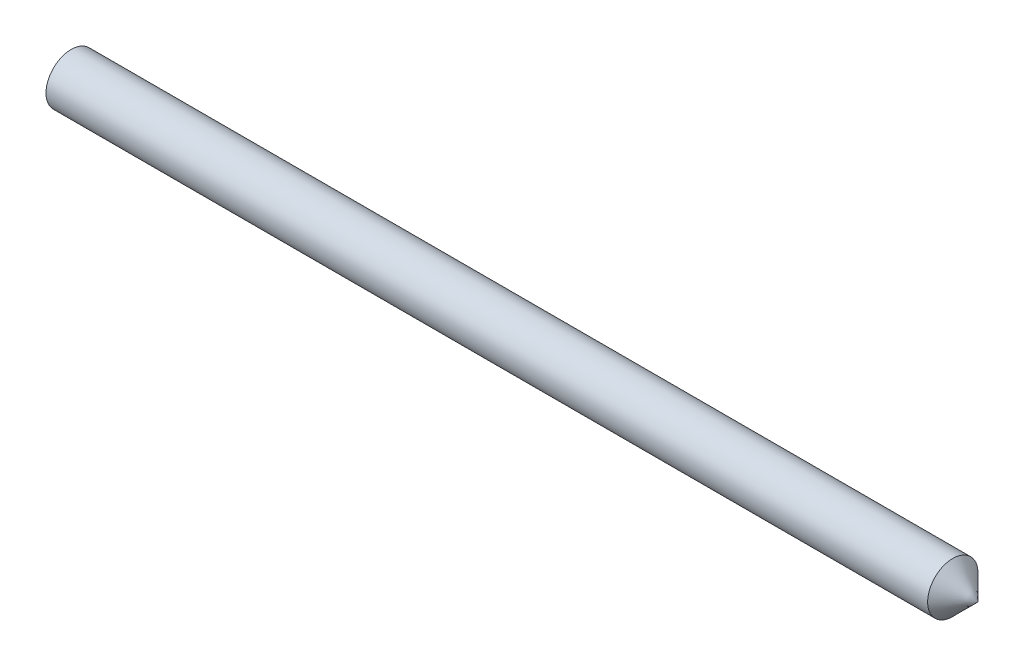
from build123d import *


with BuildPart() as part:
    # Sketch1 → Revolve1 (revolve)
    with BuildSketch(Plane.XY, mode=Mode.PRIVATE) as revolve1_sk:
        Polygon((80.01, 0), (77.7875, 2.2225), (0, 2.2225), (0, 0), align=None)
    revolve(revolve1_sk.sketch.rotate(Axis((0, 0, 0), (1, 0, 0)), 90), axis=Axis((0, 0, 0), (1, 0, 0)))


solid = part.part
